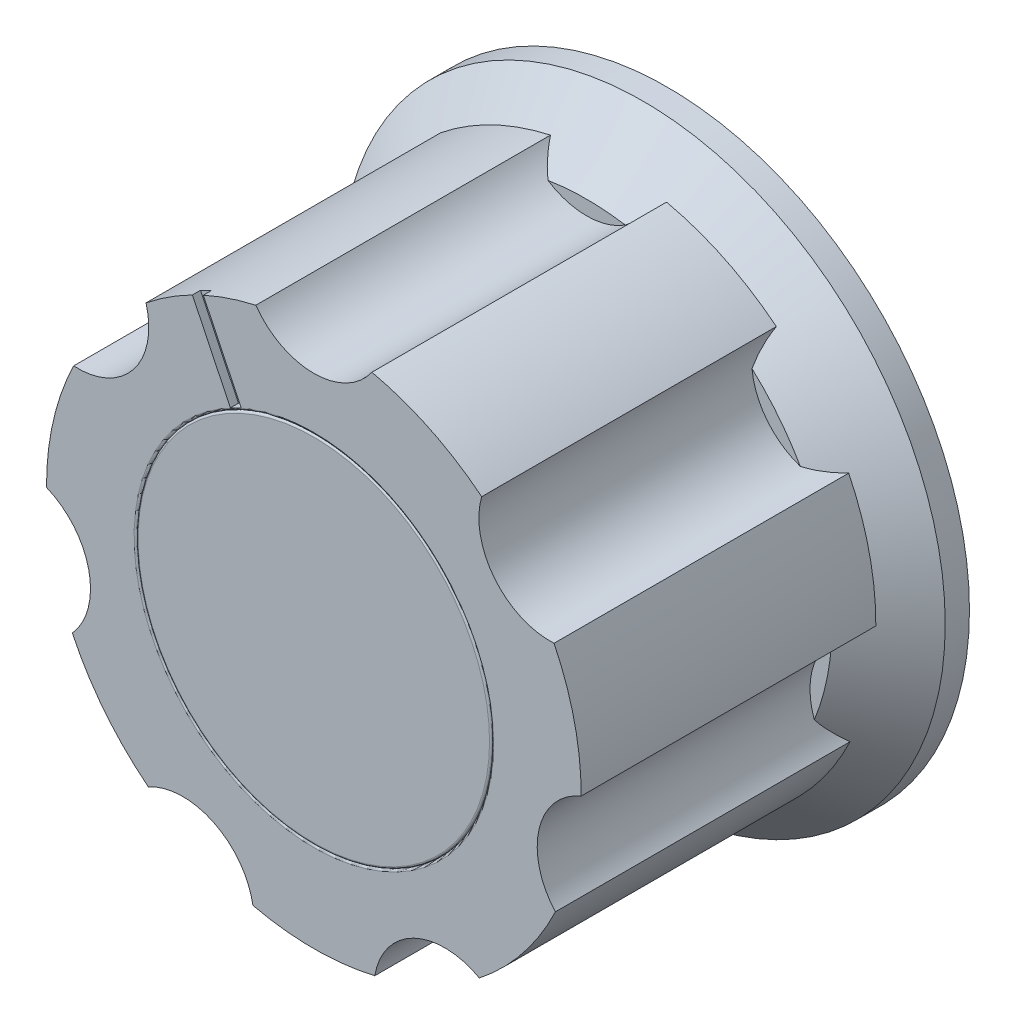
ISO-10303-21;
HEADER;
FILE_DESCRIPTION(('STEP AP214'),'2;1');
FILE_NAME('part.step','',(''),(''),'','','');
FILE_SCHEMA(('AUTOMOTIVE_DESIGN { 1 0 10303 214 1 1 1 1 }'));
ENDSEC;
DATA;
#1=APPLICATION_CONTEXT('core data for automotive mechanical design processes');
#2=APPLICATION_PROTOCOL_DEFINITION('international standard','automotive_design',2000,#1);
#3=PRODUCT_CONTEXT('',#1,'mechanical');
#4=PRODUCT('Part','Part','',(#3));
#5=PRODUCT_RELATED_PRODUCT_CATEGORY('part','',(#4));
#6=PRODUCT_DEFINITION_FORMATION('','',#4);
#7=PRODUCT_DEFINITION_CONTEXT('part definition',#1,'design');
#8=PRODUCT_DEFINITION('design','',#6,#7);
#9=PRODUCT_DEFINITION_SHAPE('','',#8);
#10=(LENGTH_UNIT() NAMED_UNIT(*) SI_UNIT(.MILLI.,.METRE.));
#11=(NAMED_UNIT(*) PLANE_ANGLE_UNIT() SI_UNIT($,.RADIAN.));
#12=(NAMED_UNIT(*) SI_UNIT($,.STERADIAN.) SOLID_ANGLE_UNIT());
#13=UNCERTAINTY_MEASURE_WITH_UNIT(LENGTH_MEASURE(1.E-05),#10,'distance_accuracy_value','');
#14=(GEOMETRIC_REPRESENTATION_CONTEXT(3) GLOBAL_UNCERTAINTY_ASSIGNED_CONTEXT((#13)) GLOBAL_UNIT_ASSIGNED_CONTEXT((#10,
#11,#12)) REPRESENTATION_CONTEXT('',''));
#15=CARTESIAN_POINT('',(0.,0.,0.));
#16=DIRECTION('',(0.,0.,1.));
#17=DIRECTION('',(1.,0.,0.));
#18=AXIS2_PLACEMENT_3D('',#15,#16,#17);
#19=CARTESIAN_POINT('',(0.,0.,11.1125));
#20=DIRECTION('',(0.,0.,-1.));
#21=DIRECTION('',(-1.,0.,0.));
#22=AXIS2_PLACEMENT_3D('',#19,#20,#21);
#23=CYLINDRICAL_SURFACE('',#22,5.58561875);
#24=CARTESIAN_POINT('',(0.,0.,11.049));
#25=DIRECTION('',(0.,0.,1.));
#26=DIRECTION('',(1.,0.,0.));
#27=AXIS2_PLACEMENT_3D('',#24,#25,#26);
#28=CIRCLE('',#27,5.58561875);
#29=CARTESIAN_POINT('',(5.58561875,0.,11.049));
#30=VERTEX_POINT('',#29);
#31=EDGE_CURVE('E11',#30,#30,#28,.F.);
#32=ORIENTED_EDGE('',*,*,#31,.T.);
#33=EDGE_LOOP('',(#32));
#34=FACE_BOUND('',#33,.T.);
#35=CARTESIAN_POINT('',(0.,0.,10.6045));
#36=DIRECTION('',(0.,0.,1.));
#37=DIRECTION('',(1.,0.,0.));
#38=AXIS2_PLACEMENT_3D('',#35,#36,#37);
#39=CIRCLE('',#38,5.58561875);
#40=CARTESIAN_POINT('',(5.58561875,0.,10.6045));
#41=VERTEX_POINT('',#40);
#42=EDGE_CURVE('E52',#41,#41,#39,.T.);
#43=ORIENTED_EDGE('',*,*,#42,.T.);
#44=EDGE_LOOP('',(#43));
#45=FACE_BOUND('',#44,.T.);
#46=ADVANCED_FACE('F41',(#34,#45),#23,.T.);
#47=CARTESIAN_POINT('',(0.,0.,11.1125));
#48=DIRECTION('',(0.,0.,1.));
#49=DIRECTION('',(1.,0.,0.));
#50=AXIS2_PLACEMENT_3D('',#47,#48,#49);
#51=PLANE('',#50);
#52=CARTESIAN_POINT('',(0.,0.,11.1125));
#53=DIRECTION('',(0.,0.,1.));
#54=DIRECTION('',(1.,0.,0.));
#55=AXIS2_PLACEMENT_3D('',#52,#53,#54);
#56=CIRCLE('',#55,5.52211875);
#57=CARTESIAN_POINT('',(5.52211875,0.,11.1125));
#58=VERTEX_POINT('',#57);
#59=EDGE_CURVE('E48',#58,#58,#56,.T.);
#60=ORIENTED_EDGE('',*,*,#59,.T.);
#61=EDGE_LOOP('',(#60));
#62=FACE_BOUND('',#61,.T.);
#63=ADVANCED_FACE('F62',(#62),#51,.T.);
#64=CARTESIAN_POINT('',(0.,0.,10.6045));
#65=DIRECTION('',(0.,0.,1.));
#66=DIRECTION('',(1.,0.,0.));
#67=AXIS2_PLACEMENT_3D('',#64,#65,#66);
#68=PLANE('',#67);
#69=ORIENTED_EDGE('',*,*,#42,.F.);
#70=EDGE_LOOP('',(#69));
#71=FACE_BOUND('',#70,.T.);
#72=ADVANCED_FACE('F60',(#71),#68,.F.);
#73=CARTESIAN_POINT('',(0.,0.,11.049));
#74=DIRECTION('',(0.,0.,1.));
#75=DIRECTION('',(1.,0.,0.));
#76=AXIS2_PLACEMENT_3D('',#73,#74,#75);
#77=TOROIDAL_SURFACE('',#76,5.52211875,0.0635);
#78=ORIENTED_EDGE('',*,*,#31,.F.);
#79=EDGE_LOOP('',(#78));
#80=FACE_BOUND('',#79,.T.);
#81=ORIENTED_EDGE('',*,*,#59,.F.);
#82=EDGE_LOOP('',(#81));
#83=FACE_BOUND('',#82,.T.);
#84=ADVANCED_FACE('F43',(#80,#83),#77,.T.);
#85=CLOSED_SHELL('',(#46,#63,#72,#84));
#86=MANIFOLD_SOLID_BREP('B2',#85);
#87=CARTESIAN_POINT('',(0.,0.,2.54));
#88=DIRECTION('',(0.,0.,1.));
#89=DIRECTION('',(1.,0.,0.));
#90=AXIS2_PLACEMENT_3D('',#87,#88,#89);
#91=PLANE('',#90);
#92=CARTESIAN_POINT('',(-4.11802674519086,-8.55117064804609,2.54));
#93=DIRECTION('',(0.,0.,-1.));
#94=DIRECTION('',(1.,0.,0.));
#95=AXIS2_PLACEMENT_3D('',#92,#93,#94);
#96=CIRCLE('',#95,2.2342475);
#97=CARTESIAN_POINT('',(-4.40020349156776,-6.33481368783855,2.54));
#98=VERTEX_POINT('',#97);
#99=CARTESIAN_POINT('',(-2.20927477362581,-7.3899093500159,2.54));
#100=VERTEX_POINT('',#99);
#101=EDGE_CURVE('E349',#98,#100,#96,.T.);
#102=ORIENTED_EDGE('',*,*,#101,.F.);
#103=CARTESIAN_POINT('',(0.,0.,2.54));
#104=DIRECTION('',(0.,0.,1.));
#105=DIRECTION('',(1.,0.,0.));
#106=AXIS2_PLACEMENT_3D('',#103,#104,#105);
#107=CIRCLE('',#106,7.71308337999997);
#108=EDGE_CURVE('E404',#98,#100,#107,.T.);
#109=ORIENTED_EDGE('',*,*,#108,.T.);
#110=EDGE_LOOP('',(#102,#109));
#111=FACE_BOUND('',#110,.T.);
#112=ADVANCED_FACE('F101',(#111),#91,.T.);
#113=CARTESIAN_POINT('',(4.11802674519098,-8.55117064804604,2.54));
#114=DIRECTION('',(0.,0.,-1.));
#115=DIRECTION('',(1.,0.,0.));
#116=AXIS2_PLACEMENT_3D('',#113,#114,#115);
#117=CIRCLE('',#116,2.2342475);
#118=CARTESIAN_POINT('',(2.20927477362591,-7.38990935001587,2.54));
#119=VERTEX_POINT('',#118);
#120=CARTESIAN_POINT('',(4.40020349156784,-6.33481368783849,2.54));
#121=VERTEX_POINT('',#120);
#122=EDGE_CURVE('E352',#119,#121,#117,.T.);
#123=ORIENTED_EDGE('',*,*,#122,.F.);
#124=CARTESIAN_POINT('',(0.,0.,2.54));
#125=DIRECTION('',(0.,0.,1.));
#126=DIRECTION('',(1.,0.,0.));
#127=AXIS2_PLACEMENT_3D('',#124,#125,#126);
#128=CIRCLE('',#127,7.71308337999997);
#129=EDGE_CURVE('E402',#119,#121,#128,.T.);
#130=ORIENTED_EDGE('',*,*,#129,.T.);
#131=EDGE_LOOP('',(#123,#130));
#132=FACE_BOUND('',#131,.T.);
#133=ADVANCED_FACE('F519',(#132),#91,.T.);
#134=CARTESIAN_POINT('',(9.25312210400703,-2.11196473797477,2.54));
#135=DIRECTION('',(0.,0.,-1.));
#136=DIRECTION('',(1.,0.,0.));
#137=AXIS2_PLACEMENT_3D('',#134,#135,#136);
#138=CIRCLE('',#137,2.2342475);
#139=CARTESIAN_POINT('',(7.15512407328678,-2.88025254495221,2.54));
#140=VERTEX_POINT('',#139);
#141=CARTESIAN_POINT('',(7.69623877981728,-0.509474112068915,2.54));
#142=VERTEX_POINT('',#141);
#143=EDGE_CURVE('E309',#140,#142,#138,.T.);
#144=ORIENTED_EDGE('',*,*,#143,.F.);
#145=CARTESIAN_POINT('',(0.,0.,2.54));
#146=DIRECTION('',(0.,0.,1.));
#147=DIRECTION('',(1.,0.,0.));
#148=AXIS2_PLACEMENT_3D('',#145,#146,#147);
#149=CIRCLE('',#148,7.71308337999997);
#150=EDGE_CURVE('E400',#140,#142,#149,.T.);
#151=ORIENTED_EDGE('',*,*,#150,.T.);
#152=EDGE_LOOP('',(#144,#151));
#153=FACE_BOUND('',#152,.T.);
#154=ADVANCED_FACE('F524',(#153),#91,.T.);
#155=CARTESIAN_POINT('',(7.42042778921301,5.91759369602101,2.54));
#156=DIRECTION('',(0.,0.,-1.));
#157=DIRECTION('',(1.,0.,0.));
#158=AXIS2_PLACEMENT_3D('',#155,#156,#157);
#159=CIRCLE('',#158,2.2342475);
#160=CARTESIAN_POINT('',(6.71301900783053,3.79829317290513,2.54));
#161=VERTEX_POINT('',#160);
#162=CARTESIAN_POINT('',(5.19684929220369,5.69950986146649,2.54));
#163=VERTEX_POINT('',#162);
#164=EDGE_CURVE('E304',#161,#163,#159,.T.);
#165=ORIENTED_EDGE('',*,*,#164,.F.);
#166=CARTESIAN_POINT('',(0.,0.,2.54));
#167=DIRECTION('',(0.,0.,1.));
#168=DIRECTION('',(1.,0.,0.));
#169=AXIS2_PLACEMENT_3D('',#166,#167,#168);
#170=CIRCLE('',#169,7.71308337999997);
#171=EDGE_CURVE('E398',#161,#163,#170,.T.);
#172=ORIENTED_EDGE('',*,*,#171,.T.);
#173=EDGE_LOOP('',(#165,#172));
#174=FACE_BOUND('',#173,.T.);
#175=ADVANCED_FACE('F514',(#174),#91,.T.);
#176=CARTESIAN_POINT('',(0.,9.49108338,2.54));
#177=DIRECTION('',(0.,0.,-1.));
#178=DIRECTION('',(1.,0.,0.));
#179=AXIS2_PLACEMENT_3D('',#176,#177,#178);
#180=CIRCLE('',#179,2.2342475);
#181=CARTESIAN_POINT('',(1.21587370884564,7.61664666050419,2.54));
#182=VERTEX_POINT('',#181);
#183=CARTESIAN_POINT('',(-1.21587370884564,7.61664666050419,2.54));
#184=VERTEX_POINT('',#183);
#185=EDGE_CURVE('E340',#182,#184,#180,.T.);
#186=ORIENTED_EDGE('',*,*,#185,.F.);
#187=CARTESIAN_POINT('',(0.,0.,2.54));
#188=DIRECTION('',(0.,0.,1.));
#189=DIRECTION('',(1.,0.,0.));
#190=AXIS2_PLACEMENT_3D('',#187,#188,#189);
#191=CIRCLE('',#190,7.71308337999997);
#192=EDGE_CURVE('E396',#182,#184,#191,.T.);
#193=ORIENTED_EDGE('',*,*,#192,.T.);
#194=EDGE_LOOP('',(#186,#193));
#195=FACE_BOUND('',#194,.T.);
#196=ADVANCED_FACE('F507',(#195),#91,.T.);
#197=CARTESIAN_POINT('',(-7.42042778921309,5.91759369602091,2.54));
#198=DIRECTION('',(0.,0.,-1.));
#199=DIRECTION('',(1.,0.,0.));
#200=AXIS2_PLACEMENT_3D('',#197,#198,#199);
#201=CIRCLE('',#200,2.2342475);
#202=CARTESIAN_POINT('',(-5.19684929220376,5.69950986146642,2.54));
#203=VERTEX_POINT('',#202);
#204=CARTESIAN_POINT('',(-6.71301900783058,3.79829317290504,2.54));
#205=VERTEX_POINT('',#204);
#206=EDGE_CURVE('E343',#203,#205,#201,.T.);
#207=ORIENTED_EDGE('',*,*,#206,.F.);
#208=CARTESIAN_POINT('',(0.,0.,2.54));
#209=DIRECTION('',(0.,0.,1.));
#210=DIRECTION('',(1.,0.,0.));
#211=AXIS2_PLACEMENT_3D('',#208,#209,#210);
#212=CIRCLE('',#211,7.71308337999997);
#213=EDGE_CURVE('E394',#203,#205,#212,.T.);
#214=ORIENTED_EDGE('',*,*,#213,.T.);
#215=EDGE_LOOP('',(#207,#214));
#216=FACE_BOUND('',#215,.T.);
#217=ADVANCED_FACE('F505',(#216),#91,.T.);
#218=CARTESIAN_POINT('',(-9.253122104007,-2.11196473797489,2.54));
#219=DIRECTION('',(0.,0.,-1.));
#220=DIRECTION('',(1.,0.,0.));
#221=AXIS2_PLACEMENT_3D('',#218,#219,#220);
#222=CIRCLE('',#221,2.2342475);
#223=CARTESIAN_POINT('',(-7.69623877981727,-0.509474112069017,2.54));
#224=VERTEX_POINT('',#223);
#225=CARTESIAN_POINT('',(-7.15512407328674,-2.88025254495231,2.54));
#226=VERTEX_POINT('',#225);
#227=EDGE_CURVE('E346',#224,#226,#222,.T.);
#228=ORIENTED_EDGE('',*,*,#227,.F.);
#229=CARTESIAN_POINT('',(0.,0.,2.54));
#230=DIRECTION('',(0.,0.,1.));
#231=DIRECTION('',(1.,0.,0.));
#232=AXIS2_PLACEMENT_3D('',#229,#230,#231);
#233=CIRCLE('',#232,7.71308337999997);
#234=EDGE_CURVE('E392',#224,#226,#233,.T.);
#235=ORIENTED_EDGE('',*,*,#234,.T.);
#236=EDGE_LOOP('',(#228,#235));
#237=FACE_BOUND('',#236,.T.);
#238=ADVANCED_FACE('F487',(#237),#91,.T.);
#239=CARTESIAN_POINT('',(0.,0.,2.54));
#240=DIRECTION('',(0.,0.,-1.));
#241=DIRECTION('',(-1.,0.,0.));
#242=AXIS2_PLACEMENT_3D('',#239,#240,#241);
#243=CYLINDRICAL_SURFACE('',#242,9.49108338);
#244=CARTESIAN_POINT('',(0.,0.,0.761999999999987));
#245=DIRECTION('',(0.,0.,1.));
#246=DIRECTION('',(1.,0.,0.));
#247=AXIS2_PLACEMENT_3D('',#244,#245,#246);
#248=CIRCLE('',#247,9.49108338);
#249=CARTESIAN_POINT('',(9.49108338,0.,0.761999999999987));
#250=VERTEX_POINT('',#249);
#251=EDGE_CURVE('E407',#250,#250,#248,.F.);
#252=ORIENTED_EDGE('',*,*,#251,.T.);
#253=EDGE_LOOP('',(#252));
#254=FACE_BOUND('',#253,.T.);
#255=CARTESIAN_POINT('',(0.,0.,0.));
#256=DIRECTION('',(0.,0.,1.));
#257=DIRECTION('',(1.,0.,0.));
#258=AXIS2_PLACEMENT_3D('',#255,#256,#257);
#259=CIRCLE('',#258,9.49108338);
#260=CARTESIAN_POINT('',(9.49108338,0.,0.));
#261=VERTEX_POINT('',#260);
#262=EDGE_CURVE('E383',#261,#261,#259,.T.);
#263=ORIENTED_EDGE('',*,*,#262,.T.);
#264=EDGE_LOOP('',(#263));
#265=FACE_BOUND('',#264,.T.);
#266=ADVANCED_FACE('F513',(#254,#265),#243,.T.);
#267=CARTESIAN_POINT('',(0.,0.,0.));
#268=DIRECTION('',(0.,0.,1.));
#269=DIRECTION('',(1.,0.,0.));
#270=AXIS2_PLACEMENT_3D('',#267,#268,#269);
#271=PLANE('',#270);
#272=ORIENTED_EDGE('',*,*,#262,.F.);
#273=EDGE_LOOP('',(#272));
#274=FACE_BOUND('',#273,.T.);
#275=ADVANCED_FACE('F650',(#274),#271,.F.);
#276=CARTESIAN_POINT('',(0.,0.,11.1125));
#277=DIRECTION('',(0.,0.,-1.));
#278=DIRECTION('',(-1.,0.,0.));
#279=AXIS2_PLACEMENT_3D('',#276,#277,#278);
#280=CYLINDRICAL_SURFACE('',#279,8.4007706);
#281=DIRECTION('',(0.,0.,-1.));
#282=VECTOR('',#281,1.);
#283=CARTESIAN_POINT('',(8.40064055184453,-0.046743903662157,11.1125));
#284=LINE('',#283,#282);
#285=CARTESIAN_POINT('',(8.40064055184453,-0.046743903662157,11.1125));
#286=VERTEX_POINT('',#285);
#287=CARTESIAN_POINT('',(8.40064055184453,-0.046743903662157,1.85231277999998));
#288=VERTEX_POINT('',#287);
#289=EDGE_CURVE('E337',#286,#288,#284,.T.);
#290=ORIENTED_EDGE('',*,*,#289,.T.);
#291=CARTESIAN_POINT('',(0.,0.,1.85231277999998));
#292=DIRECTION('',(0.,0.,-1.));
#293=DIRECTION('',(-1.,0.,0.));
#294=AXIS2_PLACEMENT_3D('',#291,#292,#293);
#295=CIRCLE('',#294,8.4007706);
#296=CARTESIAN_POINT('',(7.54843418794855,3.68701613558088,1.85231277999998));
#297=VERTEX_POINT('',#296);
#298=EDGE_CURVE('E561',#288,#297,#295,.F.);
#299=ORIENTED_EDGE('',*,*,#298,.T.);
#300=DIRECTION('',(0.,0.,-1.));
#301=VECTOR('',#300,1.);
#302=CARTESIAN_POINT('',(7.54843418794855,3.68701613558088,11.1125));
#303=LINE('',#302,#301);
#304=CARTESIAN_POINT('',(7.54843418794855,3.68701613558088,11.1125));
#305=VERTEX_POINT('',#304);
#306=EDGE_CURVE('E381',#305,#297,#303,.T.);
#307=ORIENTED_EDGE('',*,*,#306,.F.);
#308=CARTESIAN_POINT('',(0.,0.,11.1125));
#309=DIRECTION('',(0.,0.,1.));
#310=DIRECTION('',(1.,0.,0.));
#311=AXIS2_PLACEMENT_3D('',#308,#309,#310);
#312=CIRCLE('',#311,8.4007706);
#313=EDGE_CURVE('E305',#286,#305,#312,.T.);
#314=ORIENTED_EDGE('',*,*,#313,.F.);
#315=EDGE_LOOP('',(#290,#299,#307,#314));
#316=FACE_BOUND('',#315,.T.);
#317=ADVANCED_FACE('F559',(#316),#280,.T.);
#318=CARTESIAN_POINT('',(7.42042778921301,5.91759369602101,11.1125));
#319=DIRECTION('',(0.,0.,-1.));
#320=DIRECTION('',(-1.,0.,0.));
#321=AXIS2_PLACEMENT_3D('',#318,#319,#320);
#322=CYLINDRICAL_SURFACE('',#321,2.2342475);
#323=ORIENTED_EDGE('',*,*,#306,.T.);
#324=CARTESIAN_POINT('',(7.54843418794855,3.68701613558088,1.85231277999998));
#325=CARTESIAN_POINT('',(7.48139491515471,3.68318790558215,1.91421748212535));
#326=CARTESIAN_POINT('',(7.41353265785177,3.68230749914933,1.97547325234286));
#327=CARTESIAN_POINT('',(7.2767941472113,3.68692102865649,2.09563246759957));
#328=CARTESIAN_POINT('',(7.20792793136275,3.69237164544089,2.15454907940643));
#329=CARTESIAN_POINT('',(7.06887067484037,3.71006408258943,2.26985679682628));
#330=CARTESIAN_POINT('',(6.99867914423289,3.72230846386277,2.3262469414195));
#331=CARTESIAN_POINT('',(6.85679345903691,3.75438518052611,2.43587110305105));
#332=CARTESIAN_POINT('',(6.78509230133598,3.77426896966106,2.48908082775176));
#333=CARTESIAN_POINT('',(6.71301900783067,3.79829317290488,2.54000000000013));
#334=B_SPLINE_CURVE_WITH_KNOTS('',3,(#324,#325,#326,#327,#328,#329,#330,#331,#332,#333),
.UNSPECIFIED.,.F.,.F.,(4,2,2,2,4),(0.,0.273992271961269,0.546120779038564,0.818351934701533,
1.09244973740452),.UNSPECIFIED.);
#335=EDGE_CURVE('E565',#297,#161,#334,.T.);
#336=ORIENTED_EDGE('',*,*,#335,.T.);
#337=ORIENTED_EDGE('',*,*,#164,.T.);
#338=CARTESIAN_POINT('',(5.19684929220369,5.69950986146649,2.54));
#339=CARTESIAN_POINT('',(5.18946524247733,5.77512201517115,2.48908082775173));
#340=CARTESIAN_POINT('',(5.18603499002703,5.84945003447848,2.43587110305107));
#341=CARTESIAN_POINT('',(5.18633503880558,5.9949160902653,2.32624694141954));
#342=CARTESIAN_POINT('',(5.19001673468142,6.06607240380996,2.2698567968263));
#343=CARTESIAN_POINT('',(5.20371103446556,6.20558014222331,2.15454907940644));
#344=CARTESIAN_POINT('',(5.21372125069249,6.27393261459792,2.09563246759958));
#345=CARTESIAN_POINT('',(5.23965057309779,6.40826941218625,1.97547325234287));
#346=CARTESIAN_POINT('',(5.25560967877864,6.47423431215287,1.91421748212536));
#347=CARTESIAN_POINT('',(5.2742595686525,6.53874090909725,1.85231277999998));
#348=B_SPLINE_CURVE_WITH_KNOTS('',3,(#338,#339,#340,#341,#342,#343,#344,#345,#346,#347),
.UNSPECIFIED.,.F.,.F.,(4,2,2,2,4),(0.,0.274097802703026,0.546328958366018,0.81845746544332,
1.09244973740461),.UNSPECIFIED.);
#349=CARTESIAN_POINT('',(5.2742595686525,6.53874090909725,1.85231277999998));
#350=VERTEX_POINT('',#349);
#351=EDGE_CURVE('E570',#163,#350,#348,.T.);
#352=ORIENTED_EDGE('',*,*,#351,.T.);
#353=DIRECTION('',(0.,0.,-1.));
#354=VECTOR('',#353,1.);
#355=CARTESIAN_POINT('',(5.2742595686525,6.53874090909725,11.1125));
#356=LINE('',#355,#354);
#357=CARTESIAN_POINT('',(5.2742595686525,6.53874090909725,11.1125));
#358=VERTEX_POINT('',#357);
#359=EDGE_CURVE('E379',#358,#350,#356,.T.);
#360=ORIENTED_EDGE('',*,*,#359,.F.);
#361=CARTESIAN_POINT('',(7.42042778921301,5.91759369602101,11.1125));
#362=DIRECTION('',(0.,0.,-1.));
#363=DIRECTION('',(1.,0.,0.));
#364=AXIS2_PLACEMENT_3D('',#361,#362,#363);
#365=CIRCLE('',#364,2.2342475);
#366=EDGE_CURVE('E308',#305,#358,#365,.T.);
#367=ORIENTED_EDGE('',*,*,#366,.F.);
#368=EDGE_LOOP('',(#323,#336,#337,#352,#360,#367));
#369=FACE_BOUND('',#368,.T.);
#370=ADVANCED_FACE('F564',(#369),#322,.F.);
#371=CARTESIAN_POINT('',(0.,0.,11.1125));
#372=DIRECTION('',(0.,0.,-1.));
#373=DIRECTION('',(-1.,0.,0.));
#374=AXIS2_PLACEMENT_3D('',#371,#372,#373);
#375=CYLINDRICAL_SURFACE('',#374,8.4007706);
#376=ORIENTED_EDGE('',*,*,#359,.T.);
#377=CARTESIAN_POINT('',(0.,0.,1.85231277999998));
#378=DIRECTION('',(0.,0.,-1.));
#379=DIRECTION('',(-1.,0.,0.));
#380=AXIS2_PLACEMENT_3D('',#377,#378,#379);
#381=CIRCLE('',#380,8.4007706);
#382=CARTESIAN_POINT('',(1.82374644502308,8.20042045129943,1.85231277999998));
#383=VERTEX_POINT('',#382);
#384=EDGE_CURVE('E867',#350,#383,#381,.F.);
#385=ORIENTED_EDGE('',*,*,#384,.T.);
#386=DIRECTION('',(0.,0.,-1.));
#387=VECTOR('',#386,1.);
#388=CARTESIAN_POINT('',(1.82374644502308,8.20042045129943,11.1125));
#389=LINE('',#388,#387);
#390=CARTESIAN_POINT('',(1.82374644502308,8.20042045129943,11.1125));
#391=VERTEX_POINT('',#390);
#392=EDGE_CURVE('E377',#391,#383,#389,.T.);
#393=ORIENTED_EDGE('',*,*,#392,.F.);
#394=CARTESIAN_POINT('',(0.,0.,11.1125));
#395=DIRECTION('',(0.,0.,1.));
#396=DIRECTION('',(1.,0.,0.));
#397=AXIS2_PLACEMENT_3D('',#394,#395,#396);
#398=CIRCLE('',#397,8.4007706);
#399=EDGE_CURVE('E311',#358,#391,#398,.T.);
#400=ORIENTED_EDGE('',*,*,#399,.F.);
#401=EDGE_LOOP('',(#376,#385,#393,#400));
#402=FACE_BOUND('',#401,.T.);
#403=ADVANCED_FACE('F575',(#402),#375,.T.);
#404=CARTESIAN_POINT('',(0.,9.49108338,11.1125));
#405=DIRECTION('',(0.,0.,-1.));
#406=DIRECTION('',(-1.,0.,0.));
#407=AXIS2_PLACEMENT_3D('',#404,#405,#406);
#408=CYLINDRICAL_SURFACE('',#407,2.2342475);
#409=ORIENTED_EDGE('',*,*,#392,.T.);
#410=CARTESIAN_POINT('',(1.82374644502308,8.20042045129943,1.85231277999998));
#411=CARTESIAN_POINT('',(1.78494117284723,8.14562017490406,1.91421748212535));
#412=CARTESIAN_POINT('',(1.74331807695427,8.09201440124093,1.97547325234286));
#413=CARTESIAN_POINT('',(1.6544560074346,7.98798441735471,2.09563246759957));
#414=CARTESIAN_POINT('',(1.60725716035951,7.93754104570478,2.15454907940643));
#415=CARTESIAN_POINT('',(1.50672387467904,7.8398527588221,2.26985679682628));
#416=CARTESIAN_POINT('',(1.45338712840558,7.79260905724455,2.3262469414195));
#417=CARTESIAN_POINT('',(1.33984426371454,7.70167786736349,2.43587110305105));
#418=CARTESIAN_POINT('',(1.27959355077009,7.65801698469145,2.48908082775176));
#419=CARTESIAN_POINT('',(1.21587370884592,7.61664666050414,2.54000000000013));
#420=B_SPLINE_CURVE_WITH_KNOTS('',3,(#410,#411,#412,#413,#414,#415,#416,#417,#418,#419),
.UNSPECIFIED.,.F.,.F.,(4,2,2,2,4),(0.,0.273992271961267,0.546120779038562,0.818351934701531,
1.09244973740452),.UNSPECIFIED.);
#421=EDGE_CURVE('E868',#383,#182,#420,.T.);
#422=ORIENTED_EDGE('',*,*,#421,.T.);
#423=ORIENTED_EDGE('',*,*,#185,.T.);
#424=CARTESIAN_POINT('',(-1.21587370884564,7.61664666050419,2.54));
#425=CARTESIAN_POINT('',(-1.27959355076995,7.65801698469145,2.48908082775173));
#426=CARTESIAN_POINT('',(-1.33984426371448,7.70167786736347,2.43587110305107));
#427=CARTESIAN_POINT('',(-1.45338712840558,7.79260905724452,2.32624694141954));
#428=CARTESIAN_POINT('',(-1.50672387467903,7.83985275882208,2.2698567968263));
#429=CARTESIAN_POINT('',(-1.60725716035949,7.93754104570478,2.15454907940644));
#430=CARTESIAN_POINT('',(-1.65445600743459,7.9879844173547,2.09563246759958));
#431=CARTESIAN_POINT('',(-1.74331807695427,8.09201440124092,1.97547325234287));
#432=CARTESIAN_POINT('',(-1.78494117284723,8.14562017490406,1.91421748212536));
#433=CARTESIAN_POINT('',(-1.82374644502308,8.20042045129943,1.85231277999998));
#434=B_SPLINE_CURVE_WITH_KNOTS('',3,(#424,#425,#426,#427,#428,#429,#430,#431,#432,#433),
.UNSPECIFIED.,.F.,.F.,(4,2,2,2,4),(0.,0.274097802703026,0.546328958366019,0.818457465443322,
1.09244973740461),.UNSPECIFIED.);
#435=CARTESIAN_POINT('',(-1.82374644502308,8.20042045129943,1.85231277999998));
#436=VERTEX_POINT('',#435);
#437=EDGE_CURVE('E584',#184,#436,#434,.T.);
#438=ORIENTED_EDGE('',*,*,#437,.T.);
#439=DIRECTION('',(0.,0.,-1.));
#440=VECTOR('',#439,1.);
#441=CARTESIAN_POINT('',(-1.82374644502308,8.20042045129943,11.1125));
#442=LINE('',#441,#440);
#443=CARTESIAN_POINT('',(-1.82374644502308,8.20042045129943,11.1125));
#444=VERTEX_POINT('',#443);
#445=EDGE_CURVE('E375',#444,#436,#442,.T.);
#446=ORIENTED_EDGE('',*,*,#445,.F.);
#447=CARTESIAN_POINT('',(0.,9.49108338,11.1125));
#448=DIRECTION('',(0.,0.,-1.));
#449=DIRECTION('',(1.,0.,0.));
#450=AXIS2_PLACEMENT_3D('',#447,#448,#449);
#451=CIRCLE('',#450,2.2342475);
#452=EDGE_CURVE('E313',#391,#444,#451,.T.);
#453=ORIENTED_EDGE('',*,*,#452,.F.);
#454=EDGE_LOOP('',(#409,#422,#423,#438,#446,#453));
#455=FACE_BOUND('',#454,.T.);
#456=ADVANCED_FACE('F582',(#455),#408,.F.);
#457=CARTESIAN_POINT('',(0.,0.,11.1125));
#458=DIRECTION('',(0.,0.,-1.));
#459=DIRECTION('',(-1.,0.,0.));
#460=AXIS2_PLACEMENT_3D('',#457,#458,#459);
#461=CYLINDRICAL_SURFACE('',#460,8.4007706);
#462=CARTESIAN_POINT('',(0.,0.,11.1125));
#463=DIRECTION('',(0.,0.,1.));
#464=DIRECTION('',(1.,0.,0.));
#465=AXIS2_PLACEMENT_3D('',#462,#463,#464);
#466=CIRCLE('',#465,8.4007706);
#467=CARTESIAN_POINT('',(-3.81565504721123,7.48423163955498,11.1125));
#468=VERTEX_POINT('',#467);
#469=CARTESIAN_POINT('',(-5.27425956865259,6.53874090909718,11.1125));
#470=VERTEX_POINT('',#469);
#471=EDGE_CURVE('E315',#468,#470,#466,.T.);
#472=ORIENTED_EDGE('',*,*,#471,.F.);
#473=DIRECTION('',(0.,0.,-1.));
#474=VECTOR('',#473,1.);
#475=CARTESIAN_POINT('',(-3.81565504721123,7.48423163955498,11.1125));
#476=LINE('',#475,#474);
#477=CARTESIAN_POINT('',(-3.81565504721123,7.48423163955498,10.8585));
#478=VERTEX_POINT('',#477);
#479=EDGE_CURVE('E299',#468,#478,#476,.T.);
#480=ORIENTED_EDGE('',*,*,#479,.T.);
#481=CARTESIAN_POINT('',(0.,0.,10.8585));
#482=DIRECTION('',(0.,0.,-1.));
#483=DIRECTION('',(-1.,0.,0.));
#484=AXIS2_PLACEMENT_3D('',#481,#482,#483);
#485=CIRCLE('',#484,8.4007706);
#486=CARTESIAN_POINT('',(-3.47238590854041,7.64954134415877,10.8585));
#487=VERTEX_POINT('',#486);
#488=EDGE_CURVE('E39',#478,#487,#485,.T.);
#489=ORIENTED_EDGE('',*,*,#488,.T.);
#490=DIRECTION('',(0.,0.,-1.));
#491=VECTOR('',#490,1.);
#492=CARTESIAN_POINT('',(-3.47238590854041,7.64954134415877,11.1125));
#493=LINE('',#492,#491);
#494=CARTESIAN_POINT('',(-3.47238590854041,7.64954134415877,11.1125));
#495=VERTEX_POINT('',#494);
#496=EDGE_CURVE('E293',#495,#487,#493,.T.);
#497=ORIENTED_EDGE('',*,*,#496,.F.);
#498=EDGE_CURVE('E316',#444,#495,#466,.T.);
#499=ORIENTED_EDGE('',*,*,#498,.F.);
#500=ORIENTED_EDGE('',*,*,#445,.T.);
#501=CARTESIAN_POINT('',(0.,0.,1.85231277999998));
#502=DIRECTION('',(0.,0.,-1.));
#503=DIRECTION('',(-1.,0.,0.));
#504=AXIS2_PLACEMENT_3D('',#501,#502,#503);
#505=CIRCLE('',#504,8.4007706);
#506=CARTESIAN_POINT('',(-5.27425956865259,6.53874090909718,1.85231277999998));
#507=VERTEX_POINT('',#506);
#508=EDGE_CURVE('E879',#436,#507,#505,.F.);
#509=ORIENTED_EDGE('',*,*,#508,.T.);
#510=DIRECTION('',(0.,0.,-1.));
#511=VECTOR('',#510,1.);
#512=CARTESIAN_POINT('',(-5.27425956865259,6.53874090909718,11.1125));
#513=LINE('',#512,#511);
#514=EDGE_CURVE('E373',#470,#507,#513,.T.);
#515=ORIENTED_EDGE('',*,*,#514,.F.);
#516=EDGE_LOOP('',(#472,#480,#489,#497,#499,#500,#509,#515));
#517=FACE_BOUND('',#516,.T.);
#518=ADVANCED_FACE('F460',(#517),#461,.T.);
#519=CARTESIAN_POINT('',(-7.42042778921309,5.91759369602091,11.1125));
#520=DIRECTION('',(0.,0.,-1.));
#521=DIRECTION('',(-1.,0.,0.));
#522=AXIS2_PLACEMENT_3D('',#519,#520,#521);
#523=CYLINDRICAL_SURFACE('',#522,2.2342475);
#524=ORIENTED_EDGE('',*,*,#514,.T.);
#525=CARTESIAN_POINT('',(-5.27425956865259,6.53874090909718,1.85231277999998));
#526=CARTESIAN_POINT('',(-5.25560967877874,6.4742343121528,1.91421748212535));
#527=CARTESIAN_POINT('',(-5.23965057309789,6.40826941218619,1.97547325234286));
#528=CARTESIAN_POINT('',(-5.21372125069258,6.27393261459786,2.09563246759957));
#529=CARTESIAN_POINT('',(-5.20371103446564,6.20558014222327,2.15454907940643));
#530=CARTESIAN_POINT('',(-5.19001673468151,6.06607240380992,2.26985679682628));
#531=CARTESIAN_POINT('',(-5.18633503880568,5.99491609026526,2.3262469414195));
#532=CARTESIAN_POINT('',(-5.18603499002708,5.84945003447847,2.43587110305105));
#533=CARTESIAN_POINT('',(-5.18946524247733,5.77512201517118,2.48908082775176));
#534=CARTESIAN_POINT('',(-5.19684929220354,5.69950986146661,2.54000000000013));
#535=B_SPLINE_CURVE_WITH_KNOTS('',3,(#525,#526,#527,#528,#529,#530,#531,#532,#533,#534),
.UNSPECIFIED.,.F.,.F.,(4,2,2,2,4),(0.,0.273992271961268,0.546120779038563,0.818351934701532,
1.09244973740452),.UNSPECIFIED.);
#536=EDGE_CURVE('E465',#507,#203,#535,.T.);
#537=ORIENTED_EDGE('',*,*,#536,.T.);
#538=ORIENTED_EDGE('',*,*,#206,.T.);
#539=CARTESIAN_POINT('',(-6.71301900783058,3.79829317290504,2.54));
#540=CARTESIAN_POINT('',(-6.78509230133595,3.77426896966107,2.48908082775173));
#541=CARTESIAN_POINT('',(-6.85679345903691,3.75438518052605,2.43587110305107));
#542=CARTESIAN_POINT('',(-6.99867914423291,3.72230846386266,2.32624694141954));
#543=CARTESIAN_POINT('',(-7.0688706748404,3.71006408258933,2.2698567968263));
#544=CARTESIAN_POINT('',(-7.20792793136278,3.6923716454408,2.15454907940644));
#545=CARTESIAN_POINT('',(-7.27679414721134,3.6869210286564,2.09563246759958));
#546=CARTESIAN_POINT('',(-7.41353265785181,3.68230749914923,1.97547325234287));
#547=CARTESIAN_POINT('',(-7.48139491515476,3.68318790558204,1.91421748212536));
#548=CARTESIAN_POINT('',(-7.54843418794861,3.68701613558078,1.85231277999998));
#549=B_SPLINE_CURVE_WITH_KNOTS('',3,(#539,#540,#541,#542,#543,#544,#545,#546,#547,#548),
.UNSPECIFIED.,.F.,.F.,(4,2,2,2,4),(0.,0.274097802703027,0.54632895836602,0.818457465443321,
1.09244973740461),.UNSPECIFIED.);
#550=CARTESIAN_POINT('',(-7.5484341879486,3.68701613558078,1.85231277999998));
#551=VERTEX_POINT('',#550);
#552=EDGE_CURVE('E471',#205,#551,#549,.T.);
#553=ORIENTED_EDGE('',*,*,#552,.T.);
#554=DIRECTION('',(0.,0.,-1.));
#555=VECTOR('',#554,1.);
#556=CARTESIAN_POINT('',(-7.5484341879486,3.68701613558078,11.1125));
#557=LINE('',#556,#555);
#558=CARTESIAN_POINT('',(-7.5484341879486,3.68701613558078,11.1125));
#559=VERTEX_POINT('',#558);
#560=EDGE_CURVE('E371',#559,#551,#557,.T.);
#561=ORIENTED_EDGE('',*,*,#560,.F.);
#562=CARTESIAN_POINT('',(-7.42042778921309,5.91759369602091,11.1125));
#563=DIRECTION('',(0.,0.,-1.));
#564=DIRECTION('',(1.,0.,0.));
#565=AXIS2_PLACEMENT_3D('',#562,#563,#564);
#566=CIRCLE('',#565,2.2342475);
#567=EDGE_CURVE('E319',#470,#559,#566,.T.);
#568=ORIENTED_EDGE('',*,*,#567,.F.);
#569=EDGE_LOOP('',(#524,#537,#538,#553,#561,#568));
#570=FACE_BOUND('',#569,.T.);
#571=ADVANCED_FACE('F455',(#570),#523,.F.);
#572=CARTESIAN_POINT('',(0.,0.,11.1125));
#573=DIRECTION('',(0.,0.,-1.));
#574=DIRECTION('',(-1.,0.,0.));
#575=AXIS2_PLACEMENT_3D('',#572,#573,#574);
#576=CYLINDRICAL_SURFACE('',#575,8.4007706);
#577=ORIENTED_EDGE('',*,*,#560,.T.);
#578=CARTESIAN_POINT('',(0.,0.,1.85231277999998));
#579=DIRECTION('',(0.,0.,-1.));
#580=DIRECTION('',(-1.,0.,0.));
#581=AXIS2_PLACEMENT_3D('',#578,#579,#580);
#582=CIRCLE('',#581,8.4007706);
#583=CARTESIAN_POINT('',(-8.40064055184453,-0.0467439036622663,1.85231277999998));
#584=VERTEX_POINT('',#583);
#585=EDGE_CURVE('E476',#551,#584,#582,.F.);
#586=ORIENTED_EDGE('',*,*,#585,.T.);
#587=DIRECTION('',(0.,0.,-1.));
#588=VECTOR('',#587,1.);
#589=CARTESIAN_POINT('',(-8.40064055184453,-0.0467439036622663,11.1125));
#590=LINE('',#589,#588);
#591=CARTESIAN_POINT('',(-8.40064055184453,-0.0467439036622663,11.1125));
#592=VERTEX_POINT('',#591);
#593=EDGE_CURVE('E369',#592,#584,#590,.T.);
#594=ORIENTED_EDGE('',*,*,#593,.F.);
#595=CARTESIAN_POINT('',(0.,0.,11.1125));
#596=DIRECTION('',(0.,0.,1.));
#597=DIRECTION('',(1.,0.,0.));
#598=AXIS2_PLACEMENT_3D('',#595,#596,#597);
#599=CIRCLE('',#598,8.4007706);
#600=EDGE_CURVE('E321',#559,#592,#599,.T.);
#601=ORIENTED_EDGE('',*,*,#600,.F.);
#602=EDGE_LOOP('',(#577,#586,#594,#601));
#603=FACE_BOUND('',#602,.T.);
#604=ADVANCED_FACE('F450',(#603),#576,.T.);
#605=CARTESIAN_POINT('',(-9.253122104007,-2.11196473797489,11.1125));
#606=DIRECTION('',(0.,0.,-1.));
#607=DIRECTION('',(-1.,0.,0.));
#608=AXIS2_PLACEMENT_3D('',#605,#606,#607);
#609=CYLINDRICAL_SURFACE('',#608,2.2342475);
#610=ORIENTED_EDGE('',*,*,#593,.T.);
#611=CARTESIAN_POINT('',(-8.40064055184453,-0.0467439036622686,1.85231277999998));
#612=CARTESIAN_POINT('',(-8.33857924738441,-0.0723820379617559,1.91421748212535));
#613=CARTESIAN_POINT('',(-8.27705547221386,-0.101033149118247,1.97547325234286));
#614=CARTESIAN_POINT('',(-8.15586006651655,-0.164518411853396,2.09563246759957));
#615=CARTESIAN_POINT('',(-8.09617868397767,-0.199309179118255,2.15454907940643));
#616=CARTESIAN_POINT('',(-7.97856888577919,-0.275584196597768,2.26985679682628));
#617=CARTESIAN_POINT('',(-7.92064113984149,-0.317070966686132,2.3262469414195));
#618=CARTESIAN_POINT('',(-7.80672412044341,-0.40753298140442,2.43587110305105));
#619=CARTESIAN_POINT('',(-7.75075086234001,-0.456557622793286,2.48908082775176));
#620=CARTESIAN_POINT('',(-7.69623877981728,-0.509474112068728,2.54000000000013));
#621=B_SPLINE_CURVE_WITH_KNOTS('',3,(#611,#612,#613,#614,#615,#616,#617,#618,#619,#620),
.UNSPECIFIED.,.F.,.F.,(4,2,2,2,4),(0.,0.273992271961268,0.546120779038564,0.818351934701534,
1.09244973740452),.UNSPECIFIED.);
#622=EDGE_CURVE('E441',#584,#224,#621,.T.);
#623=ORIENTED_EDGE('',*,*,#622,.T.);
#624=ORIENTED_EDGE('',*,*,#227,.T.);
#625=CARTESIAN_POINT('',(-7.15512407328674,-2.88025254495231,2.54));
#626=CARTESIAN_POINT('',(-7.18127815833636,-2.95158056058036,2.48908082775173));
#627=CARTESIAN_POINT('',(-7.21043732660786,-3.02003612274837,2.43587110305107));
#628=CARTESIAN_POINT('',(-7.27382301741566,-3.1509663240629,2.32624694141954));
#629=CARTESIAN_POINT('',(-7.30801367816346,-3.21347851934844,2.2698567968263));
#630=CARTESIAN_POINT('',(-7.38088195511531,-3.3332289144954,2.15454907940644));
#631=CARTESIAN_POINT('',(-7.41955787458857,-3.39046909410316,2.09563246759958));
#632=CARTESIAN_POINT('',(-7.50120593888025,-3.50025205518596,1.97547325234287));
#633=CARTESIAN_POINT('',(-7.5442056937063,-3.55275997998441,1.91421748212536));
#634=CARTESIAN_POINT('',(-7.58899702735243,-3.60278653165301,1.85231277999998));
#635=B_SPLINE_CURVE_WITH_KNOTS('',3,(#625,#626,#627,#628,#629,#630,#631,#632,#633,#634),
.UNSPECIFIED.,.F.,.F.,(4,2,2,2,4),(0.,0.274097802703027,0.54632895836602,0.818457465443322,
1.09244973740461),.UNSPECIFIED.);
#636=CARTESIAN_POINT('',(-7.58899702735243,-3.60278653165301,1.85231277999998));
#637=VERTEX_POINT('',#636);
#638=EDGE_CURVE('E435',#226,#637,#635,.T.);
#639=ORIENTED_EDGE('',*,*,#638,.T.);
#640=DIRECTION('',(0.,0.,-1.));
#641=VECTOR('',#640,1.);
#642=CARTESIAN_POINT('',(-7.58899702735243,-3.60278653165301,11.1125));
#643=LINE('',#642,#641);
#644=CARTESIAN_POINT('',(-7.58899702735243,-3.60278653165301,11.1125));
#645=VERTEX_POINT('',#644);
#646=EDGE_CURVE('E367',#645,#637,#643,.T.);
#647=ORIENTED_EDGE('',*,*,#646,.F.);
#648=CARTESIAN_POINT('',(-9.253122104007,-2.11196473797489,11.1125));
#649=DIRECTION('',(0.,0.,-1.));
#650=DIRECTION('',(1.,0.,0.));
#651=AXIS2_PLACEMENT_3D('',#648,#649,#650);
#652=CIRCLE('',#651,2.2342475);
#653=EDGE_CURVE('E323',#592,#645,#652,.T.);
#654=ORIENTED_EDGE('',*,*,#653,.F.);
#655=EDGE_LOOP('',(#610,#623,#624,#639,#647,#654));
#656=FACE_BOUND('',#655,.T.);
#657=ADVANCED_FACE('F446',(#656),#609,.F.);
#658=CARTESIAN_POINT('',(0.,0.,11.1125));
#659=DIRECTION('',(0.,0.,-1.));
#660=DIRECTION('',(-1.,0.,0.));
#661=AXIS2_PLACEMENT_3D('',#658,#659,#660);
#662=CYLINDRICAL_SURFACE('',#661,8.4007706);
#663=ORIENTED_EDGE('',*,*,#646,.T.);
#664=CARTESIAN_POINT('',(0.,0.,1.85231277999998));
#665=DIRECTION('',(0.,0.,-1.));
#666=DIRECTION('',(-1.,0.,0.));
#667=AXIS2_PLACEMENT_3D('',#664,#665,#666);
#668=CIRCLE('',#667,8.4007706);
#669=CARTESIAN_POINT('',(-5.20116785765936,-6.59702960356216,1.85231277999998));
#670=VERTEX_POINT('',#669);
#671=EDGE_CURVE('E433',#637,#670,#668,.F.);
#672=ORIENTED_EDGE('',*,*,#671,.T.);
#673=DIRECTION('',(0.,0.,-1.));
#674=VECTOR('',#673,1.);
#675=CARTESIAN_POINT('',(-5.20116785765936,-6.59702960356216,11.1125));
#676=LINE('',#675,#674);
#677=CARTESIAN_POINT('',(-5.20116785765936,-6.59702960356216,11.1125));
#678=VERTEX_POINT('',#677);
#679=EDGE_CURVE('E125',#678,#670,#676,.T.);
#680=ORIENTED_EDGE('',*,*,#679,.F.);
#681=CARTESIAN_POINT('',(0.,0.,11.1125));
#682=DIRECTION('',(0.,0.,1.));
#683=DIRECTION('',(1.,0.,0.));
#684=AXIS2_PLACEMENT_3D('',#681,#682,#683);
#685=CIRCLE('',#684,8.4007706);
#686=EDGE_CURVE('E325',#645,#678,#685,.T.);
#687=ORIENTED_EDGE('',*,*,#686,.F.);
#688=EDGE_LOOP('',(#663,#672,#680,#687));
#689=FACE_BOUND('',#688,.T.);
#690=ADVANCED_FACE('F425',(#689),#662,.T.);
#691=CARTESIAN_POINT('',(-4.11802674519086,-8.55117064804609,11.1125));
#692=DIRECTION('',(0.,0.,-1.));
#693=DIRECTION('',(-1.,0.,0.));
#694=AXIS2_PLACEMENT_3D('',#691,#692,#693);
#695=CYLINDRICAL_SURFACE('',#694,2.2342475);
#696=ORIENTED_EDGE('',*,*,#679,.T.);
#697=CARTESIAN_POINT('',(-5.20116785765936,-6.59702960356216,1.85231277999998));
#698=CARTESIAN_POINT('',(-5.14242856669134,-6.56449323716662,1.91421748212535));
#699=CARTESIAN_POINT('',(-5.08166877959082,-6.53425568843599,1.97547325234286));
#700=CARTESIAN_POINT('',(-4.95646990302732,-6.47908371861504,2.09563246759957));
#701=CARTESIAN_POINT('',(-4.89205865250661,-6.4541146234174,2.15454907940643));
#702=CARTESIAN_POINT('',(-4.75909593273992,-6.4097202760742,2.26985679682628));
#703=CARTESIAN_POINT('',(-4.6905429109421,-6.39029711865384,2.3262469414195));
#704=CARTESIAN_POINT('',(-4.54879076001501,-6.35763535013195,2.43587110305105));
#705=CARTESIAN_POINT('',(-4.47556299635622,-6.34444005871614,2.48908082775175));
#706=CARTESIAN_POINT('',(-4.40020349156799,-6.33481368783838,2.54000000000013));
#707=B_SPLINE_CURVE_WITH_KNOTS('',3,(#697,#698,#699,#700,#701,#702,#703,#704,#705,#706),
.UNSPECIFIED.,.F.,.F.,(4,2,2,2,4),(0.,0.273992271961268,0.546120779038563,0.818351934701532,
1.09244973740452),.UNSPECIFIED.);
#708=EDGE_CURVE('E110',#670,#98,#707,.T.);
#709=ORIENTED_EDGE('',*,*,#708,.T.);
#710=ORIENTED_EDGE('',*,*,#101,.T.);
#711=CARTESIAN_POINT('',(-2.20927477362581,-7.3899093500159,2.54));
#712=CARTESIAN_POINT('',(-2.16981509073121,-7.45482972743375,2.48908082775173));
#713=CARTESIAN_POINT('',(-2.13447482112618,-7.52030862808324,2.43587110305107));
#714=CARTESIAN_POINT('',(-2.07162979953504,-7.65149920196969,2.32624694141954));
#715=CARTESIAN_POINT('',(-2.04407332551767,-7.71720625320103,2.2698567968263));
#716=CARTESIAN_POINT('',(-1.99588132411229,-7.84884011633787,2.15454907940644));
#717=CARTESIAN_POINT('',(-1.97524319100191,-7.91476683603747,2.09563246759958));
#718=CARTESIAN_POINT('',(-1.94031815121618,-8.04705041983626,1.97547325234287));
#719=CARTESIAN_POINT('',(-1.92607571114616,-8.11340713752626,1.91421748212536));
#720=CARTESIAN_POINT('',(-1.91489031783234,-8.17961745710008,1.85231277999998));
#721=B_SPLINE_CURVE_WITH_KNOTS('',3,(#711,#712,#713,#714,#715,#716,#717,#718,#719,#720),
.UNSPECIFIED.,.F.,.F.,(4,2,2,2,4),(0.,0.274097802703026,0.546328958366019,0.81845746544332,
1.09244973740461),.UNSPECIFIED.);
#722=CARTESIAN_POINT('',(-1.91489031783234,-8.17961745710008,1.85231277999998));
#723=VERTEX_POINT('',#722);
#724=EDGE_CURVE('E410',#100,#723,#721,.T.);
#725=ORIENTED_EDGE('',*,*,#724,.T.);
#726=DIRECTION('',(0.,0.,-1.));
#727=VECTOR('',#726,1.);
#728=CARTESIAN_POINT('',(-1.91489031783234,-8.17961745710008,11.1125));
#729=LINE('',#728,#727);
#730=CARTESIAN_POINT('',(-1.91489031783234,-8.17961745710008,11.1125));
#731=VERTEX_POINT('',#730);
#732=EDGE_CURVE('E364',#731,#723,#729,.T.);
#733=ORIENTED_EDGE('',*,*,#732,.F.);
#734=CARTESIAN_POINT('',(-4.11802674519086,-8.55117064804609,11.1125));
#735=DIRECTION('',(0.,0.,-1.));
#736=DIRECTION('',(1.,0.,0.));
#737=AXIS2_PLACEMENT_3D('',#734,#735,#736);
#738=CIRCLE('',#737,2.2342475);
#739=EDGE_CURVE('E327',#678,#731,#738,.T.);
#740=ORIENTED_EDGE('',*,*,#739,.F.);
#741=EDGE_LOOP('',(#696,#709,#710,#725,#733,#740));
#742=FACE_BOUND('',#741,.T.);
#743=ADVANCED_FACE('F419',(#742),#695,.F.);
#744=CARTESIAN_POINT('',(0.,0.,11.1125));
#745=DIRECTION('',(0.,0.,-1.));
#746=DIRECTION('',(-1.,0.,0.));
#747=AXIS2_PLACEMENT_3D('',#744,#745,#746);
#748=CYLINDRICAL_SURFACE('',#747,8.4007706);
#749=ORIENTED_EDGE('',*,*,#732,.T.);
#750=CARTESIAN_POINT('',(0.,0.,1.85231277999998));
#751=DIRECTION('',(0.,0.,-1.));
#752=DIRECTION('',(-1.,0.,0.));
#753=AXIS2_PLACEMENT_3D('',#750,#751,#752);
#754=CIRCLE('',#753,8.4007706);
#755=CARTESIAN_POINT('',(1.91489031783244,-8.17961745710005,1.85231277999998));
#756=VERTEX_POINT('',#755);
#757=EDGE_CURVE('E417',#723,#756,#754,.F.);
#758=ORIENTED_EDGE('',*,*,#757,.T.);
#759=DIRECTION('',(0.,0.,-1.));
#760=VECTOR('',#759,1.);
#761=CARTESIAN_POINT('',(1.91489031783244,-8.17961745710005,11.1125));
#762=LINE('',#761,#760);
#763=CARTESIAN_POINT('',(1.91489031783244,-8.17961745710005,11.1125));
#764=VERTEX_POINT('',#763);
#765=EDGE_CURVE('E362',#764,#756,#762,.T.);
#766=ORIENTED_EDGE('',*,*,#765,.F.);
#767=CARTESIAN_POINT('',(0.,0.,11.1125));
#768=DIRECTION('',(0.,0.,1.));
#769=DIRECTION('',(1.,0.,0.));
#770=AXIS2_PLACEMENT_3D('',#767,#768,#769);
#771=CIRCLE('',#770,8.4007706);
#772=EDGE_CURVE('E329',#731,#764,#771,.T.);
#773=ORIENTED_EDGE('',*,*,#772,.F.);
#774=EDGE_LOOP('',(#749,#758,#766,#773));
#775=FACE_BOUND('',#774,.T.);
#776=ADVANCED_FACE('F424',(#775),#748,.T.);
#777=CARTESIAN_POINT('',(4.11802674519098,-8.55117064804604,11.1125));
#778=DIRECTION('',(0.,0.,-1.));
#779=DIRECTION('',(-1.,0.,0.));
#780=AXIS2_PLACEMENT_3D('',#777,#778,#779);
#781=CYLINDRICAL_SURFACE('',#780,2.2342475);
#782=ORIENTED_EDGE('',*,*,#765,.T.);
#783=CARTESIAN_POINT('',(1.91489031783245,-8.17961745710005,1.85231277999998));
#784=CARTESIAN_POINT('',(1.92607571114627,-8.11340713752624,1.91421748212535));
#785=CARTESIAN_POINT('',(1.94031815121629,-8.04705041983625,1.97547325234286));
#786=CARTESIAN_POINT('',(1.975243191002,-7.91476683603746,2.09563246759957));
#787=CARTESIAN_POINT('',(1.99588132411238,-7.84884011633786,2.15454907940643));
#788=CARTESIAN_POINT('',(2.04407332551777,-7.71720625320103,2.26985679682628));
#789=CARTESIAN_POINT('',(2.07162979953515,-7.65149920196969,2.3262469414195));
#790=CARTESIAN_POINT('',(2.13447482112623,-7.52030862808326,2.43587110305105));
#791=CARTESIAN_POINT('',(2.16981509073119,-7.45482972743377,2.48908082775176));
#792=CARTESIAN_POINT('',(2.20927477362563,-7.38990935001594,2.54000000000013));
#793=B_SPLINE_CURVE_WITH_KNOTS('',3,(#783,#784,#785,#786,#787,#788,#789,#790,#791,#792),
.UNSPECIFIED.,.F.,.F.,(4,2,2,2,4),(0.,0.273992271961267,0.546120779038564,0.818351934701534,
1.09244973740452),.UNSPECIFIED.);
#794=EDGE_CURVE('E883',#756,#119,#793,.T.);
#795=ORIENTED_EDGE('',*,*,#794,.T.);
#796=ORIENTED_EDGE('',*,*,#122,.T.);
#797=CARTESIAN_POINT('',(4.40020349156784,-6.33481368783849,2.54));
#798=CARTESIAN_POINT('',(4.47556299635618,-6.34444005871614,2.48908082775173));
#799=CARTESIAN_POINT('',(4.54879076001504,-6.3576353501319,2.43587110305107));
#800=CARTESIAN_POINT('',(4.69054291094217,-6.39029711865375,2.32624694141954));
#801=CARTESIAN_POINT('',(4.75909593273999,-6.40972027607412,2.2698567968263));
#802=CARTESIAN_POINT('',(4.89205865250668,-6.45411462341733,2.15454907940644));
#803=CARTESIAN_POINT('',(4.95646990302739,-6.47908371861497,2.09563246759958));
#804=CARTESIAN_POINT('',(5.0816687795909,-6.53425568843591,1.97547325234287));
#805=CARTESIAN_POINT('',(5.14242856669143,-6.56449323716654,1.91421748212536));
#806=CARTESIAN_POINT('',(5.20116785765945,-6.59702960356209,1.85231277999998));
#807=B_SPLINE_CURVE_WITH_KNOTS('',3,(#797,#798,#799,#800,#801,#802,#803,#804,#805,#806),
.UNSPECIFIED.,.F.,.F.,(4,2,2,2,4),(0.,0.274097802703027,0.546328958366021,0.818457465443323,
1.09244973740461),.UNSPECIFIED.);
#808=CARTESIAN_POINT('',(5.20116785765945,-6.59702960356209,1.85231277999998));
#809=VERTEX_POINT('',#808);
#810=EDGE_CURVE('E542',#121,#809,#807,.T.);
#811=ORIENTED_EDGE('',*,*,#810,.T.);
#812=DIRECTION('',(0.,0.,-1.));
#813=VECTOR('',#812,1.);
#814=CARTESIAN_POINT('',(5.20116785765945,-6.59702960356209,11.1125));
#815=LINE('',#814,#813);
#816=CARTESIAN_POINT('',(5.20116785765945,-6.59702960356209,11.1125));
#817=VERTEX_POINT('',#816);
#818=EDGE_CURVE('E360',#817,#809,#815,.T.);
#819=ORIENTED_EDGE('',*,*,#818,.F.);
#820=CARTESIAN_POINT('',(4.11802674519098,-8.55117064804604,11.1125));
#821=DIRECTION('',(0.,0.,-1.));
#822=DIRECTION('',(1.,0.,0.));
#823=AXIS2_PLACEMENT_3D('',#820,#821,#822);
#824=CIRCLE('',#823,2.2342475);
#825=EDGE_CURVE('E331',#764,#817,#824,.T.);
#826=ORIENTED_EDGE('',*,*,#825,.F.);
#827=EDGE_LOOP('',(#782,#795,#796,#811,#819,#826));
#828=FACE_BOUND('',#827,.T.);
#829=ADVANCED_FACE('F540',(#828),#781,.F.);
#830=CARTESIAN_POINT('',(0.,0.,11.1125));
#831=DIRECTION('',(0.,0.,-1.));
#832=DIRECTION('',(-1.,0.,0.));
#833=AXIS2_PLACEMENT_3D('',#830,#831,#832);
#834=CYLINDRICAL_SURFACE('',#833,8.4007706);
#835=ORIENTED_EDGE('',*,*,#818,.T.);
#836=CARTESIAN_POINT('',(0.,0.,1.85231277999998));
#837=DIRECTION('',(0.,0.,-1.));
#838=DIRECTION('',(-1.,0.,0.));
#839=AXIS2_PLACEMENT_3D('',#836,#837,#838);
#840=CIRCLE('',#839,8.4007706);
#841=CARTESIAN_POINT('',(7.58899702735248,-3.60278653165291,1.85231277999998));
#842=VERTEX_POINT('',#841);
#843=EDGE_CURVE('E548',#809,#842,#840,.F.);
#844=ORIENTED_EDGE('',*,*,#843,.T.);
#845=DIRECTION('',(0.,0.,-1.));
#846=VECTOR('',#845,1.);
#847=CARTESIAN_POINT('',(7.58899702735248,-3.60278653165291,11.1125));
#848=LINE('',#847,#846);
#849=CARTESIAN_POINT('',(7.58899702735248,-3.60278653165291,11.1125));
#850=VERTEX_POINT('',#849);
#851=EDGE_CURVE('E358',#850,#842,#848,.T.);
#852=ORIENTED_EDGE('',*,*,#851,.F.);
#853=CARTESIAN_POINT('',(0.,0.,11.1125));
#854=DIRECTION('',(0.,0.,1.));
#855=DIRECTION('',(1.,0.,0.));
#856=AXIS2_PLACEMENT_3D('',#853,#854,#855);
#857=CIRCLE('',#856,8.4007706);
#858=EDGE_CURVE('E333',#817,#850,#857,.T.);
#859=ORIENTED_EDGE('',*,*,#858,.F.);
#860=EDGE_LOOP('',(#835,#844,#852,#859));
#861=FACE_BOUND('',#860,.T.);
#862=ADVANCED_FACE('F546',(#861),#834,.T.);
#863=CARTESIAN_POINT('',(9.25312210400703,-2.11196473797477,11.1125));
#864=DIRECTION('',(0.,0.,-1.));
#865=DIRECTION('',(-1.,0.,0.));
#866=AXIS2_PLACEMENT_3D('',#863,#864,#865);
#867=CYLINDRICAL_SURFACE('',#866,2.2342475);
#868=ORIENTED_EDGE('',*,*,#851,.T.);
#869=CARTESIAN_POINT('',(7.58899702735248,-3.60278653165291,1.85231277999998));
#870=CARTESIAN_POINT('',(7.54420569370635,-3.5527599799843,1.91421748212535));
#871=CARTESIAN_POINT('',(7.50120593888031,-3.50025205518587,1.97547325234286));
#872=CARTESIAN_POINT('',(7.41955787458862,-3.39046909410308,2.09563246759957));
#873=CARTESIAN_POINT('',(7.38088195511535,-3.33322891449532,2.15454907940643));
#874=CARTESIAN_POINT('',(7.30801367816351,-3.21347851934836,2.26985679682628));
#875=CARTESIAN_POINT('',(7.27382301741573,-3.15096632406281,2.3262469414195));
#876=CARTESIAN_POINT('',(7.21043732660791,-3.02003612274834,2.43587110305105));
#877=CARTESIAN_POINT('',(7.18127815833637,-2.95158056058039,2.48908082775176));
#878=CARTESIAN_POINT('',(7.15512407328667,-2.88025254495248,2.54000000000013));
#879=B_SPLINE_CURVE_WITH_KNOTS('',3,(#869,#870,#871,#872,#873,#874,#875,#876,#877,#878),
.UNSPECIFIED.,.F.,.F.,(4,2,2,2,4),(0.,0.273992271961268,0.546120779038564,0.818351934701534,
1.09244973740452),.UNSPECIFIED.);
#880=EDGE_CURVE('E624',#842,#140,#879,.T.);
#881=ORIENTED_EDGE('',*,*,#880,.T.);
#882=ORIENTED_EDGE('',*,*,#143,.T.);
#883=CARTESIAN_POINT('',(7.69623877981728,-0.509474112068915,2.54));
#884=CARTESIAN_POINT('',(7.75075086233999,-0.45655762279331,2.48908082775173));
#885=CARTESIAN_POINT('',(7.80672412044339,-0.407532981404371,2.43587110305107));
#886=CARTESIAN_POINT('',(7.92064113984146,-0.317070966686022,2.32624694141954));
#887=CARTESIAN_POINT('',(7.97856888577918,-0.275584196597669,2.2698567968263));
#888=CARTESIAN_POINT('',(8.09617868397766,-0.199309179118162,2.15454907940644));
#889=CARTESIAN_POINT('',(8.15586006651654,-0.164518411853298,2.09563246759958));
#890=CARTESIAN_POINT('',(8.27705547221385,-0.101033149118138,1.97547325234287));
#891=CARTESIAN_POINT('',(8.3385792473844,-0.0723820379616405,1.91421748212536));
#892=CARTESIAN_POINT('',(8.40064055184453,-0.0467439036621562,1.85231277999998));
#893=B_SPLINE_CURVE_WITH_KNOTS('',3,(#883,#884,#885,#886,#887,#888,#889,#890,#891,#892),
.UNSPECIFIED.,.F.,.F.,(4,2,2,2,4),(0.,0.274097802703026,0.546328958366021,0.818457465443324,
1.09244973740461),.UNSPECIFIED.);
#894=EDGE_CURVE('E630',#142,#288,#893,.T.);
#895=ORIENTED_EDGE('',*,*,#894,.T.);
#896=ORIENTED_EDGE('',*,*,#289,.F.);
#897=CARTESIAN_POINT('',(9.25312210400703,-2.11196473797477,11.1125));
#898=DIRECTION('',(0.,0.,-1.));
#899=DIRECTION('',(1.,0.,0.));
#900=AXIS2_PLACEMENT_3D('',#897,#898,#899);
#901=CIRCLE('',#900,2.2342475);
#902=EDGE_CURVE('E335',#850,#286,#901,.T.);
#903=ORIENTED_EDGE('',*,*,#902,.F.);
#904=EDGE_LOOP('',(#868,#881,#882,#895,#896,#903));
#905=FACE_BOUND('',#904,.T.);
#906=ADVANCED_FACE('F552',(#905),#867,.F.);
#907=CARTESIAN_POINT('',(3.71021389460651,2.9587968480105,11.1125));
#908=DIRECTION('',(0.,0.,1.));
#909=DIRECTION('',(1.,0.,0.));
#910=AXIS2_PLACEMENT_3D('',#907,#908,#909);
#911=PLANE('',#910);
#912=DIRECTION('',(0.433883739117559,-0.900968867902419,0.));
#913=VECTOR('',#912,1.);
#914=CARTESIAN_POINT('',(-3.81659232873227,7.48617792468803,11.1125));
#915=LINE('',#914,#913);
#916=CARTESIAN_POINT('',(-2.62269533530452,5.00702527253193,11.1125));
#917=VERTEX_POINT('',#916);
#918=EDGE_CURVE('E290',#468,#917,#915,.T.);
#919=ORIENTED_EDGE('',*,*,#918,.F.);
#920=ORIENTED_EDGE('',*,*,#471,.T.);
#921=ORIENTED_EDGE('',*,*,#567,.T.);
#922=ORIENTED_EDGE('',*,*,#600,.T.);
#923=ORIENTED_EDGE('',*,*,#653,.T.);
#924=ORIENTED_EDGE('',*,*,#686,.T.);
#925=ORIENTED_EDGE('',*,*,#739,.T.);
#926=ORIENTED_EDGE('',*,*,#772,.T.);
#927=ORIENTED_EDGE('',*,*,#825,.T.);
#928=ORIENTED_EDGE('',*,*,#858,.T.);
#929=ORIENTED_EDGE('',*,*,#902,.T.);
#930=ORIENTED_EDGE('',*,*,#313,.T.);
#931=ORIENTED_EDGE('',*,*,#366,.T.);
#932=ORIENTED_EDGE('',*,*,#399,.T.);
#933=ORIENTED_EDGE('',*,*,#452,.T.);
#934=ORIENTED_EDGE('',*,*,#498,.T.);
#935=DIRECTION('',(0.433883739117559,-0.900968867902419,0.));
#936=VECTOR('',#935,1.);
#937=CARTESIAN_POINT('',(-3.47332319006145,7.65148762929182,11.1125));
#938=LINE('',#937,#936);
#939=CARTESIAN_POINT('',(-2.2794261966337,5.17233497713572,11.1125));
#940=VERTEX_POINT('',#939);
#941=EDGE_CURVE('E280',#495,#940,#938,.T.);
#942=ORIENTED_EDGE('',*,*,#941,.T.);
#943=DIRECTION('',(-0.90096886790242,-0.433883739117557,0.));
#944=VECTOR('',#943,1.);
#945=CARTESIAN_POINT('',(-2.2794261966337,5.17233497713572,11.1125));
#946=LINE('',#945,#944);
#947=CARTESIAN_POINT('',(-2.4510607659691,5.08968012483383,11.1125));
#948=VERTEX_POINT('',#947);
#949=EDGE_CURVE('E592',#940,#948,#946,.T.);
#950=ORIENTED_EDGE('',*,*,#949,.T.);
#951=CARTESIAN_POINT('',(0.,0.,11.1125));
#952=DIRECTION('',(0.,0.,1.));
#953=DIRECTION('',(1.,0.,0.));
#954=AXIS2_PLACEMENT_3D('',#951,#952,#953);
#955=CIRCLE('',#954,5.64911875);
#956=EDGE_CURVE('E389',#948,#948,#955,.F.);
#957=ORIENTED_EDGE('',*,*,#956,.T.);
#958=EDGE_CURVE('E593',#948,#917,#946,.T.);
#959=ORIENTED_EDGE('',*,*,#958,.T.);
#960=EDGE_LOOP('',(#919,#920,#921,#922,#923,#924,#925,#926,#927,#928,#929,#930,#931,#932,#933,
#934,#942,#950,#957,#959));
#961=FACE_BOUND('',#960,.T.);
#962=ADVANCED_FACE('F494',(#961),#911,.T.);
#963=CARTESIAN_POINT('',(0.,0.,10.6045));
#964=DIRECTION('',(0.,0.,1.));
#965=DIRECTION('',(1.,0.,0.));
#966=AXIS2_PLACEMENT_3D('',#963,#964,#965);
#967=CYLINDRICAL_SURFACE('',#966,5.58561875);
#968=CARTESIAN_POINT('',(0.,0.,11.049));
#969=DIRECTION('',(0.,0.,1.));
#970=DIRECTION('',(1.,0.,0.));
#971=AXIS2_PLACEMENT_3D('',#968,#969,#970);
#972=CIRCLE('',#971,5.58561875);
#973=CARTESIAN_POINT('',(5.58561875,0.,11.049));
#974=VERTEX_POINT('',#973);
#975=EDGE_CURVE('E386',#974,#974,#972,.T.);
#976=ORIENTED_EDGE('',*,*,#975,.T.);
#977=EDGE_LOOP('',(#976));
#978=FACE_BOUND('',#977,.T.);
#979=CARTESIAN_POINT('',(0.,0.,10.6045));
#980=DIRECTION('',(0.,0.,1.));
#981=DIRECTION('',(1.,0.,0.));
#982=AXIS2_PLACEMENT_3D('',#979,#980,#981);
#983=CIRCLE('',#982,5.58561875);
#984=CARTESIAN_POINT('',(5.58561875,0.,10.6045));
#985=VERTEX_POINT('',#984);
#986=EDGE_CURVE('E301',#985,#985,#983,.T.);
#987=ORIENTED_EDGE('',*,*,#986,.F.);
#988=EDGE_LOOP('',(#987));
#989=FACE_BOUND('',#988,.T.);
#990=ADVANCED_FACE('F604',(#978,#989),#967,.F.);
#991=CARTESIAN_POINT('',(0.,0.,10.6045));
#992=DIRECTION('',(0.,0.,1.));
#993=DIRECTION('',(1.,0.,0.));
#994=AXIS2_PLACEMENT_3D('',#991,#992,#993);
#995=PLANE('',#994);
#996=ORIENTED_EDGE('',*,*,#986,.T.);
#997=EDGE_LOOP('',(#996));
#998=FACE_BOUND('',#997,.T.);
#999=ADVANCED_FACE('F601',(#998),#995,.T.);
#1000=CARTESIAN_POINT('',(0.,0.,11.049));
#1001=DIRECTION('',(0.,0.,1.));
#1002=DIRECTION('',(1.,0.,0.));
#1003=AXIS2_PLACEMENT_3D('',#1000,#1001,#1002);
#1004=TOROIDAL_SURFACE('',#1003,5.64911875,0.0635);
#1005=ORIENTED_EDGE('',*,*,#956,.F.);
#1006=EDGE_LOOP('',(#1005));
#1007=FACE_BOUND('',#1006,.T.);
#1008=ORIENTED_EDGE('',*,*,#975,.F.);
#1009=EDGE_LOOP('',(#1008));
#1010=FACE_BOUND('',#1009,.T.);
#1011=ADVANCED_FACE('F598',(#1007,#1010),#1004,.T.);
#1012=CARTESIAN_POINT('',(0.,0.,2.54));
#1013=DIRECTION('',(0.,0.,-1.));
#1014=DIRECTION('',(-1.,0.,0.));
#1015=AXIS2_PLACEMENT_3D('',#1012,#1013,#1014);
#1016=CONICAL_SURFACE('',#1015,7.71308337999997,0.785398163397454);
#1017=ORIENTED_EDGE('',*,*,#251,.F.);
#1018=EDGE_LOOP('',(#1017));
#1019=FACE_BOUND('',#1018,.T.);
#1020=ORIENTED_EDGE('',*,*,#724,.F.);
#1021=ORIENTED_EDGE('',*,*,#108,.F.);
#1022=ORIENTED_EDGE('',*,*,#708,.F.);
#1023=ORIENTED_EDGE('',*,*,#671,.F.);
#1024=ORIENTED_EDGE('',*,*,#638,.F.);
#1025=ORIENTED_EDGE('',*,*,#234,.F.);
#1026=ORIENTED_EDGE('',*,*,#622,.F.);
#1027=ORIENTED_EDGE('',*,*,#585,.F.);
#1028=ORIENTED_EDGE('',*,*,#552,.F.);
#1029=ORIENTED_EDGE('',*,*,#213,.F.);
#1030=ORIENTED_EDGE('',*,*,#536,.F.);
#1031=ORIENTED_EDGE('',*,*,#508,.F.);
#1032=ORIENTED_EDGE('',*,*,#437,.F.);
#1033=ORIENTED_EDGE('',*,*,#192,.F.);
#1034=ORIENTED_EDGE('',*,*,#421,.F.);
#1035=ORIENTED_EDGE('',*,*,#384,.F.);
#1036=ORIENTED_EDGE('',*,*,#351,.F.);
#1037=ORIENTED_EDGE('',*,*,#171,.F.);
#1038=ORIENTED_EDGE('',*,*,#335,.F.);
#1039=ORIENTED_EDGE('',*,*,#298,.F.);
#1040=ORIENTED_EDGE('',*,*,#894,.F.);
#1041=ORIENTED_EDGE('',*,*,#150,.F.);
#1042=ORIENTED_EDGE('',*,*,#880,.F.);
#1043=ORIENTED_EDGE('',*,*,#843,.F.);
#1044=ORIENTED_EDGE('',*,*,#810,.F.);
#1045=ORIENTED_EDGE('',*,*,#129,.F.);
#1046=ORIENTED_EDGE('',*,*,#794,.F.);
#1047=ORIENTED_EDGE('',*,*,#757,.F.);
#1048=EDGE_LOOP('',(#1020,#1021,#1022,#1023,#1024,#1025,#1026,#1027,#1028,#1029,#1030,#1031,
#1032,#1033,#1034,#1035,#1036,#1037,#1038,#1039,#1040,#1041,#1042,#1043,#1044,#1045,#1046,#1047));
#1049=FACE_BOUND('',#1048,.T.);
#1050=ADVANCED_FACE('F103',(#1019,#1049),#1016,.T.);
#1051=CARTESIAN_POINT('',(-2.62269533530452,5.00702527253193,10.8585));
#1052=DIRECTION('',(0.,0.,-1.));
#1053=DIRECTION('',(-1.,0.,0.));
#1054=AXIS2_PLACEMENT_3D('',#1051,#1052,#1053);
#1055=PLANE('',#1054);
#1056=DIRECTION('',(0.433883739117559,-0.900968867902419,0.));
#1057=VECTOR('',#1056,1.);
#1058=CARTESIAN_POINT('',(-3.81659232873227,7.48617792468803,10.8585));
#1059=LINE('',#1058,#1057);
#1060=CARTESIAN_POINT('',(-2.62269533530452,5.00702527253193,10.8585));
#1061=VERTEX_POINT('',#1060);
#1062=EDGE_CURVE('E274',#478,#1061,#1059,.T.);
#1063=ORIENTED_EDGE('',*,*,#1062,.T.);
#1064=DIRECTION('',(-0.90096886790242,-0.433883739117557,0.));
#1065=VECTOR('',#1064,1.);
#1066=CARTESIAN_POINT('',(-2.2794261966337,5.17233497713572,10.8585));
#1067=LINE('',#1066,#1065);
#1068=CARTESIAN_POINT('',(-2.2794261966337,5.17233497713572,10.8585));
#1069=VERTEX_POINT('',#1068);
#1070=EDGE_CURVE('E277',#1069,#1061,#1067,.T.);
#1071=ORIENTED_EDGE('',*,*,#1070,.F.);
#1072=DIRECTION('',(0.433883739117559,-0.900968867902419,0.));
#1073=VECTOR('',#1072,1.);
#1074=CARTESIAN_POINT('',(-3.47332319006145,7.65148762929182,10.8585));
#1075=LINE('',#1074,#1073);
#1076=EDGE_CURVE('E286',#487,#1069,#1075,.T.);
#1077=ORIENTED_EDGE('',*,*,#1076,.F.);
#1078=ORIENTED_EDGE('',*,*,#488,.F.);
#1079=EDGE_LOOP('',(#1063,#1071,#1077,#1078));
#1080=FACE_BOUND('',#1079,.T.);
#1081=ADVANCED_FACE('F275',(#1080),#1055,.F.);
#1082=CARTESIAN_POINT('',(-3.81659232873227,7.48617792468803,10.8585));
#1083=DIRECTION('',(-0.900968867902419,-0.433883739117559,0.));
#1084=DIRECTION('',(0.433883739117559,-0.900968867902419,0.));
#1085=AXIS2_PLACEMENT_3D('',#1082,#1083,#1084);
#1086=PLANE('',#1085);
#1087=ORIENTED_EDGE('',*,*,#918,.T.);
#1088=DIRECTION('',(0.,0.,1.));
#1089=VECTOR('',#1088,1.);
#1090=CARTESIAN_POINT('',(-2.62269533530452,5.00702527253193,10.8585));
#1091=LINE('',#1090,#1089);
#1092=EDGE_CURVE('E117',#1061,#917,#1091,.T.);
#1093=ORIENTED_EDGE('',*,*,#1092,.F.);
#1094=ORIENTED_EDGE('',*,*,#1062,.F.);
#1095=ORIENTED_EDGE('',*,*,#479,.F.);
#1096=EDGE_LOOP('',(#1087,#1093,#1094,#1095));
#1097=FACE_BOUND('',#1096,.T.);
#1098=ADVANCED_FACE('F288',(#1097),#1086,.F.);
#1099=CARTESIAN_POINT('',(-3.47332319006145,7.65148762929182,10.8585));
#1100=DIRECTION('',(-0.900968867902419,-0.433883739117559,0.));
#1101=DIRECTION('',(0.433883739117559,-0.900968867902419,0.));
#1102=AXIS2_PLACEMENT_3D('',#1099,#1100,#1101);
#1103=PLANE('',#1102);
#1104=ORIENTED_EDGE('',*,*,#496,.T.);
#1105=ORIENTED_EDGE('',*,*,#1076,.T.);
#1106=DIRECTION('',(0.,0.,1.));
#1107=VECTOR('',#1106,1.);
#1108=CARTESIAN_POINT('',(-2.2794261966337,5.17233497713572,10.8585));
#1109=LINE('',#1108,#1107);
#1110=EDGE_CURVE('E285',#1069,#940,#1109,.T.);
#1111=ORIENTED_EDGE('',*,*,#1110,.T.);
#1112=ORIENTED_EDGE('',*,*,#941,.F.);
#1113=EDGE_LOOP('',(#1104,#1105,#1111,#1112));
#1114=FACE_BOUND('',#1113,.T.);
#1115=ADVANCED_FACE('F590',(#1114),#1103,.T.);
#1116=CARTESIAN_POINT('',(-2.2794261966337,5.17233497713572,10.8585));
#1117=DIRECTION('',(-0.433883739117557,0.90096886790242,0.));
#1118=DIRECTION('',(-0.90096886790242,-0.433883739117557,0.));
#1119=AXIS2_PLACEMENT_3D('',#1116,#1117,#1118);
#1120=PLANE('',#1119);
#1121=ORIENTED_EDGE('',*,*,#949,.F.);
#1122=ORIENTED_EDGE('',*,*,#1110,.F.);
#1123=ORIENTED_EDGE('',*,*,#1070,.T.);
#1124=ORIENTED_EDGE('',*,*,#1092,.T.);
#1125=ORIENTED_EDGE('',*,*,#958,.F.);
#1126=EDGE_LOOP('',(#1121,#1122,#1123,#1124,#1125));
#1127=FACE_BOUND('',#1126,.T.);
#1128=ADVANCED_FACE('F284',(#1127),#1120,.T.);
#1129=CLOSED_SHELL('',(#112,#133,#154,#175,#196,#217,#238,#266,#275,#317,#370,#403,#456,#518,
#571,#604,#657,#690,#743,#776,#829,#862,#906,#962,#990,#999,#1011,#1050,#1081,#1098,#1115,#1128));
#1130=MANIFOLD_SOLID_BREP('B6',#1129);
#1131=ADVANCED_BREP_SHAPE_REPRESENTATION('',(#18,#86,#1130),#14);
#1132=SHAPE_DEFINITION_REPRESENTATION(#9,#1131);
ENDSEC;
END-ISO-10303-21;
